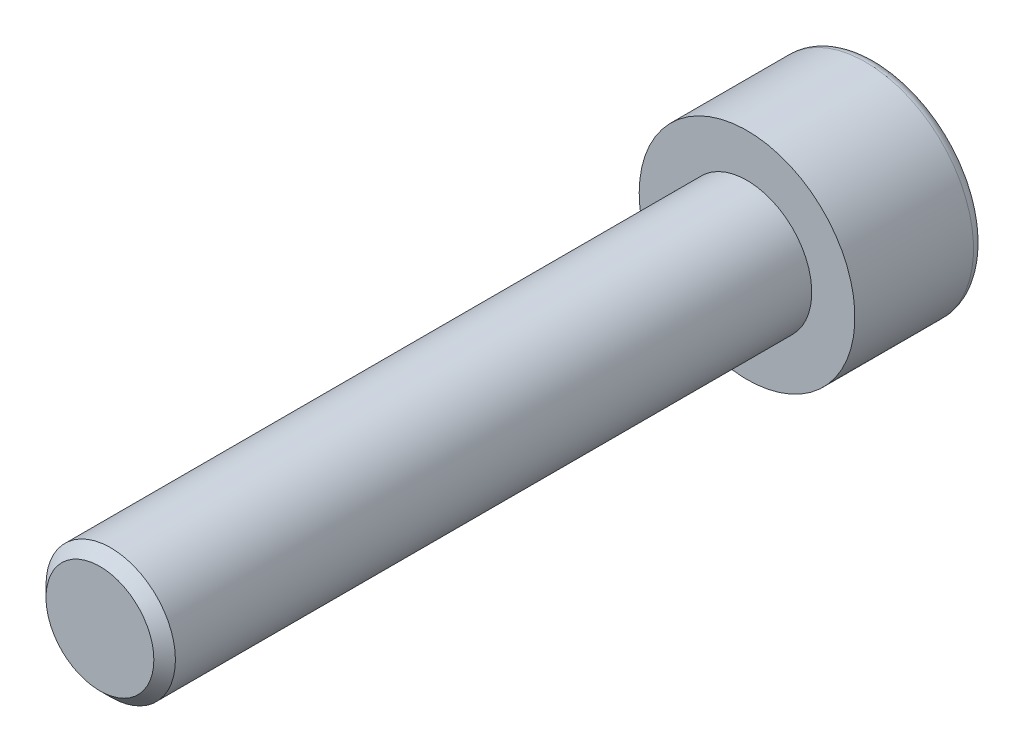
from build123d import *

# Parameters (mm, degrees)
ESQUISSE1_R             = 3
BASE_EXTRUSION_DEPTH    = 30
CHANFREIN1_SIZE         = 0.5
ESQUISSE2_R             = 5
BOSS_EXTRU_1_DEPTH      = 6
CONG_1_R                = 0.5
ENL_V_MAT_EXTRU_1_DEPTH = 4


with BuildPart() as part:
    # Esquisse1 → Base-Extrusion (new body)
    with BuildSketch(Plane.XY):
        Circle(ESQUISSE1_R)
    extrude(amount=BASE_EXTRUSION_DEPTH)

    # Chanfrein1
    chanfrein1_edges = [part.edges().sort_by_distance(p)[0] for p in [
        (-3, 0, 30),
    ]]
    chamfer(chanfrein1_edges, length=CHANFREIN1_SIZE)

    # Esquisse2 → Boss.-Extru.1 (add)
    with BuildSketch(Plane(origin=(0, 0, 0), x_dir=(-1, 0, 0), z_dir=(0, 0, -1))):
        Circle(ESQUISSE2_R)
    extrude(amount=BOSS_EXTRU_1_DEPTH)

    # Cong_1
    cong_1_edges = [part.edges().sort_by_distance(p)[0] for p in [
        (5, 0, -6),
    ]]
    fillet(cong_1_edges, radius=CONG_1_R)

    # Esquisse3 → Enl_v. mat.-Extru.1 (cut)
    with BuildSketch(Plane(origin=(0, 0, -6), x_dir=(-1, 0, 0), z_dir=(0, 0, -1))):
        Polygon((0, 2.886751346), (-2.5, 1.443375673), (-2.5, -1.443375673), (0, -2.886751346), (2.5, -1.443375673), (2.5, 1.443375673), align=None)
    extrude(amount=-ENL_V_MAT_EXTRU_1_DEPTH, mode=Mode.SUBTRACT)


solid = part.part
